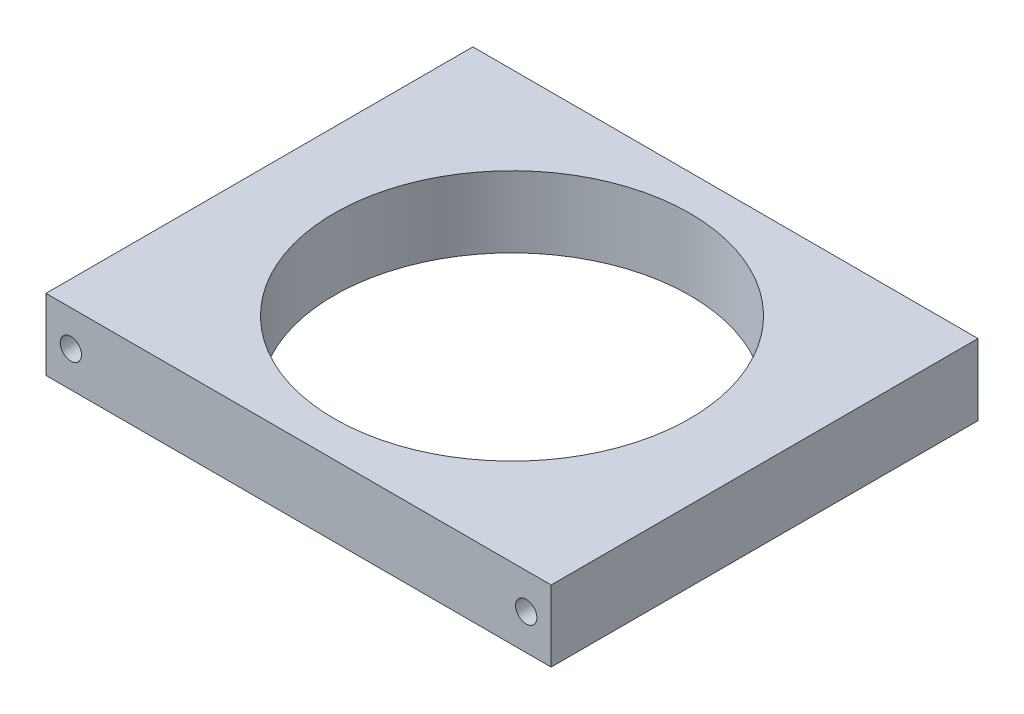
from build123d import *

# Parameters (mm, degrees)
SKETCH_1_W          = 71
SKETCH_1_H          = 60
EXTRUDE_1_DEPTH     = 10
SKETCH_2_R          = 25
CUT_EXTRUDE_1_DEPTH = 48.542086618
SKETCH_3_R          = 1.5
CUT_EXTRUDE_2_DEPTH = 71.429042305


with BuildPart() as part:
    # Sketch 1 → Extrude 1 (new body)
    with BuildSketch(Plane(origin=(0, 0, 0), x_dir=(1, 0, 0), z_dir=(0, 1, 0))):
        Rectangle(SKETCH_1_W, SKETCH_1_H)
    extrude(amount=EXTRUDE_1_DEPTH)

    # Sketch 2 → Cut-Extrude 1 (cut, through all)
    with BuildSketch(Plane(origin=(0, 10, 0), x_dir=(1, 0, 0), z_dir=(0, 1, 0))):
        with Locations(Location((0, 0, 0), (0, 0, 270))):
            Circle(SKETCH_2_R)
    extrude(amount=-CUT_EXTRUDE_1_DEPTH, mode=Mode.SUBTRACT)

    # Sketch 3 → Cut-Extrude 2 (cut, through all)
    with BuildSketch(Plane(origin=(0, 0, -30), x_dir=(-1, 0, 0), z_dir=(0, 0, -1))):
        with Locations((-32, 5)):
            Circle(SKETCH_3_R)
        with Locations((32, 5)):
            Circle(SKETCH_3_R)
    extrude(amount=-CUT_EXTRUDE_2_DEPTH, mode=Mode.SUBTRACT)


solid = part.part
